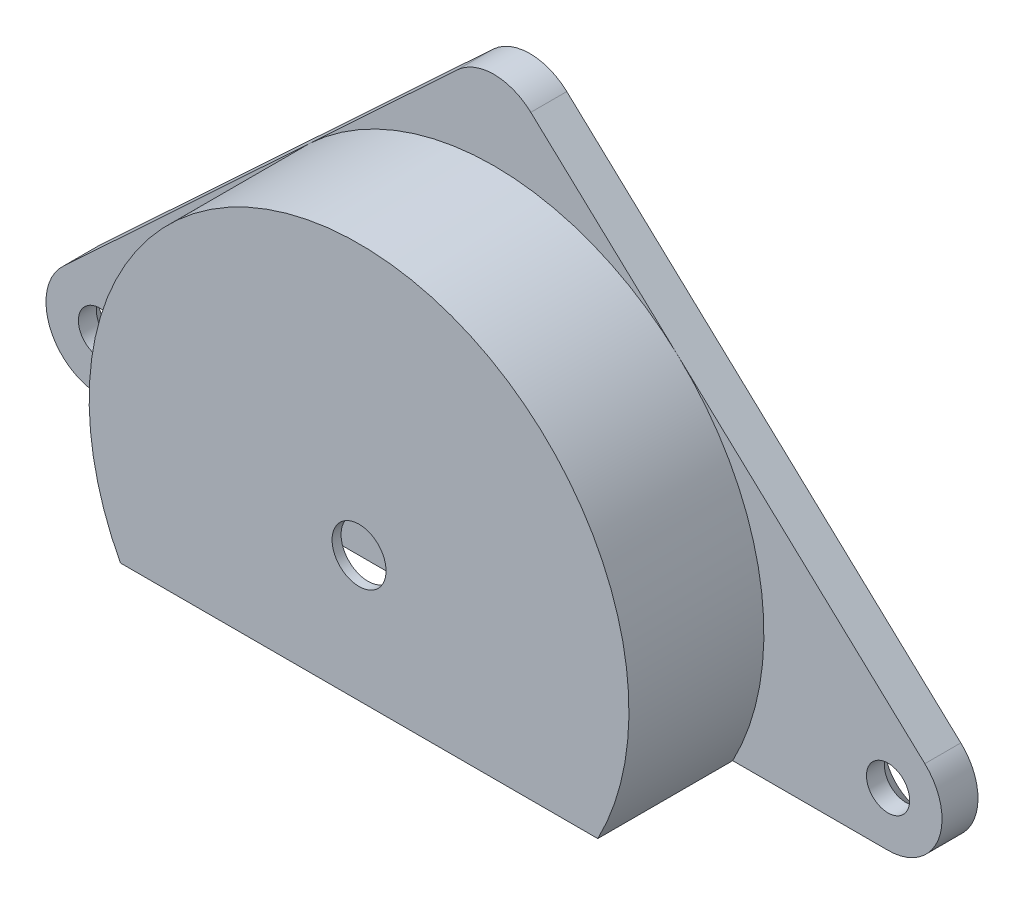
from build123d import *

# Parameters (mm, degrees)
SKETCH1_R                                    = 15
BOSS_EXTRUDE1_DEPTH                          = 3.75
CUT_EXTRUDE1_DEPTH                           = 7.5
SHELL1_T                                     = -0.5
BOSS_EXTRUDE2_DEPTH                          = 2
FILLET1_R                                    = 3
CSK_FOR_M2_COUNTERSUNK_FLAT_HEAD_SCR_2_COUNT = 2
CSK_FOR_M2_COUNTERSUNK_FLAT_HEAD_SCR_2_PITCH = 43.798163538
SKETCH9_R                                    = 1.5
CUT_EXTRUDE2_DEPTH                           = 33.96322607


with BuildPart() as part:
    # Sketch1 → Boss-Extrude1 (new, symmetric)
    with BuildSketch(Plane.XY):
        Circle(SKETCH1_R)
    extrude(amount=BOSS_EXTRUDE1_DEPTH, both=True)

    # Sketch2 → Cut-Extrude1 (cut)
    with BuildSketch(Plane.XY.offset(3.75)):
        with BuildLine():
            Line((-13.266499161, -7), (13.266499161, -7))
            ThreePointArc((13.266499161, -7), (0, -15), (-13.266499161, -7))
        make_face()
    extrude(amount=-CUT_EXTRUDE1_DEPTH, mode=Mode.SUBTRACT)

    # Shell1
    shell1_openings = [part.faces().sort_by_distance(p)[0] for p in [
        (0, -7, 0),
    ]]
    offset(amount=SHELL1_T, openings=shell1_openings)

    # Sketch3 → Boss-Extrude2 (add)
    with BuildSketch(Plane(origin=(0, 0, -3.75), x_dir=(-1, 0, 0), z_dir=(0, 0, -1))):
        Polygon((-29.520821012, -7), (29.520821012, -7), (0, 20.5), align=None)
    extrude(amount=BOSS_EXTRUDE2_DEPTH)

    # Fillet1
    fillet1_edges = [part.edges().sort_by_distance(p)[0] for p in [
        (-29.520821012, -7, -4.75),
        (0, 20.5, -4.75),
        (29.520821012, -7, -4.75),
    ]]
    fillet(fillet1_edges, radius=FILLET1_R)

    # Sketch8 → CSK for M2 Countersunk Flat Head Screw1 (revolve, cut)
    with BuildSketch(Plane(origin=(21.899081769, -4, -5.75), x_dir=(0, 1, 0), z_dir=(1, 0, 0))):
        Polygon((0, 0), (0, 2), (1.2, 2), (1.2, 1), (2.2, 0), align=None)
    csk_for_m2_countersunk_flat_head_screw1 = revolve(axis=Axis((21.899081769, -4, -12.1), (0, 0, 1)), mode=Mode.SUBTRACT)

    # CSK for M2 Countersunk Flat Head Scr 2: CSK for M2 Countersunk Flat Head Screw1 ×2
    with Locations(*[(-i * CSK_FOR_M2_COUNTERSUNK_FLAT_HEAD_SCR_2_PITCH, 0, 0) for i in range(1, CSK_FOR_M2_COUNTERSUNK_FLAT_HEAD_SCR_2_COUNT)]):
        add(csk_for_m2_countersunk_flat_head_screw1, mode=Mode.SUBTRACT)

    # Sketch9 → Cut-Extrude2 (cut, through all)
    with BuildSketch(Plane.XY.offset(3.75)):
        Circle(SKETCH9_R)
    extrude(amount=-CUT_EXTRUDE2_DEPTH, mode=Mode.SUBTRACT)


solid = part.part
